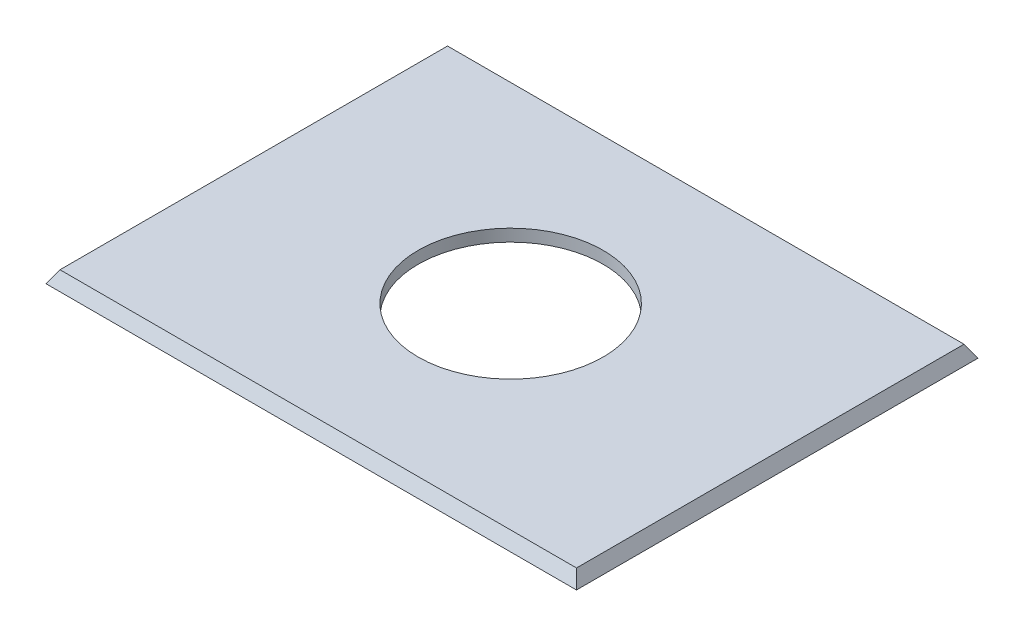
from build123d import *

# Parameters (mm, degrees)
SKETCH1_W          = 111.357497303
SKETCH1_H          = 84.286105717
EXTRUDE1_DEPTH     = 2.54
EXTRUDE1_TAPER     = 30
SKETCH2_R          = 19.413247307
CUT_EXTRUDE1_DEPTH = 140.682108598


with BuildPart() as part:
    # Sketch1 → Extrude1 (new body)
    with BuildSketch(Plane(origin=(0, 0, 0), x_dir=(1, 0, 0), z_dir=(0, 1, 0))):
        with Locations((55.678748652, 42.143052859)):
            Rectangle(SKETCH1_W, SKETCH1_H)
    extrude(amount=EXTRUDE1_DEPTH, taper=EXTRUDE1_TAPER)

    # Sketch2 → Cut-Extrude1 (cut, through all)
    with BuildSketch(Plane(origin=(0, 2.54, 0), x_dir=(-1, 0, 0), z_dir=(0, 1, 0))):
        with Locations(Location((-54.936146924, -42.607178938, 0), (0, 0, 90))):
            Circle(SKETCH2_R)
    extrude(amount=-CUT_EXTRUDE1_DEPTH, mode=Mode.SUBTRACT)


solid = part.part
